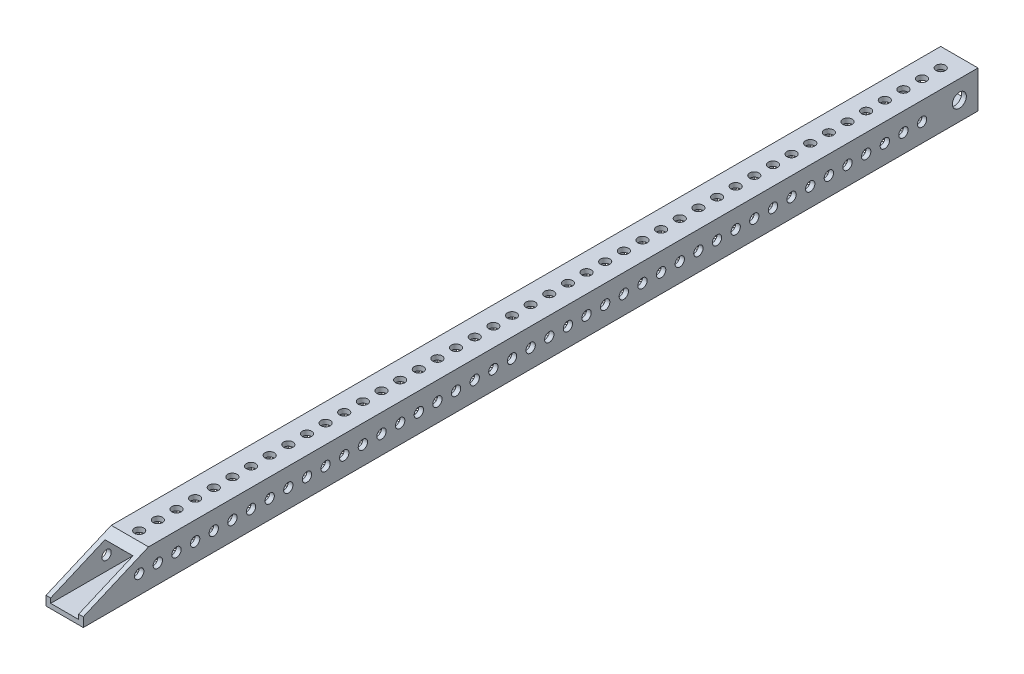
from build123d import *

# Parameters (mm, degrees)
SKETCH1_W           = 25.4
SKETCH1_H           = 25.4
SKETCH1_W_2         = 19.05
SKETCH1_H_2         = 19.05
BOSS_EXTRUDE1_DEPTH = 609.6
SKETCH2_R           = 4.7625
CUT_EXTRUDE1_DEPTH  = 611.261099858
SKETCH3_R           = 3.175
CUT_EXTRUDE2_DEPTH  = 611.261099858
LPATTERN1_COUNT     = 44
LPATTERN1_PITCH     = 12.7
SKETCH4_R           = 3.175
CUT_EXTRUDE3_DEPTH  = 611.261099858
LPATTERN2_COUNT     = 43
LPATTERN2_PITCH     = 12.7


with BuildPart() as part:
    # Sketch1 → Boss-Extrude1 (new body)
    with BuildSketch(Plane.XY):
        Rectangle(SKETCH1_W, SKETCH1_H)
        Rectangle(SKETCH1_W_2, SKETCH1_H_2, mode=Mode.SUBTRACT)
    extrude(amount=BOSS_EXTRUDE1_DEPTH)

    # Sketch2 → Cut-Extrude1 (cut, through all)
    with BuildSketch(Plane.ZY.offset(12.7)):
        with Locations((12.7, 0)):
            Circle(SKETCH2_R)
        Polygon((609.6, -6.35), (565.15, 12.7), (609.6, 12.7), align=None)
    extrude(amount=-CUT_EXTRUDE1_DEPTH, mode=Mode.SUBTRACT)

    # Sketch3 → Cut-Extrude2 (cut, through all)
    with BuildSketch(Plane(origin=(0, 12.7, 0), x_dir=(1, 0, 0), z_dir=(0, 1, 0))):
        with Locations(Location((0, -12.7, 0), (0, 0, 270))):
            Circle(SKETCH3_R)
    cut_extrude2 = extrude(amount=-CUT_EXTRUDE2_DEPTH, mode=Mode.SUBTRACT)

    # LPattern1: Cut-Extrude2 ×44
    with Locations(*[(0, 0, i * LPATTERN1_PITCH) for i in range(1, LPATTERN1_COUNT)]):
        add(cut_extrude2, mode=Mode.SUBTRACT)

    # Sketch4 → Cut-Extrude3 (cut, through all)
    with BuildSketch(Plane(origin=(12.7, 0, 0), x_dir=(0, 0, -1), z_dir=(1, 0, 0))):
        with Locations((-38.1, 0)):
            Circle(SKETCH4_R)
    cut_extrude3 = extrude(amount=-CUT_EXTRUDE3_DEPTH, mode=Mode.SUBTRACT)

    # LPattern2: Cut-Extrude3 ×43
    with Locations(*[(0, 0, i * LPATTERN2_PITCH) for i in range(1, LPATTERN2_COUNT)]):
        add(cut_extrude3, mode=Mode.SUBTRACT)


solid = part.part
